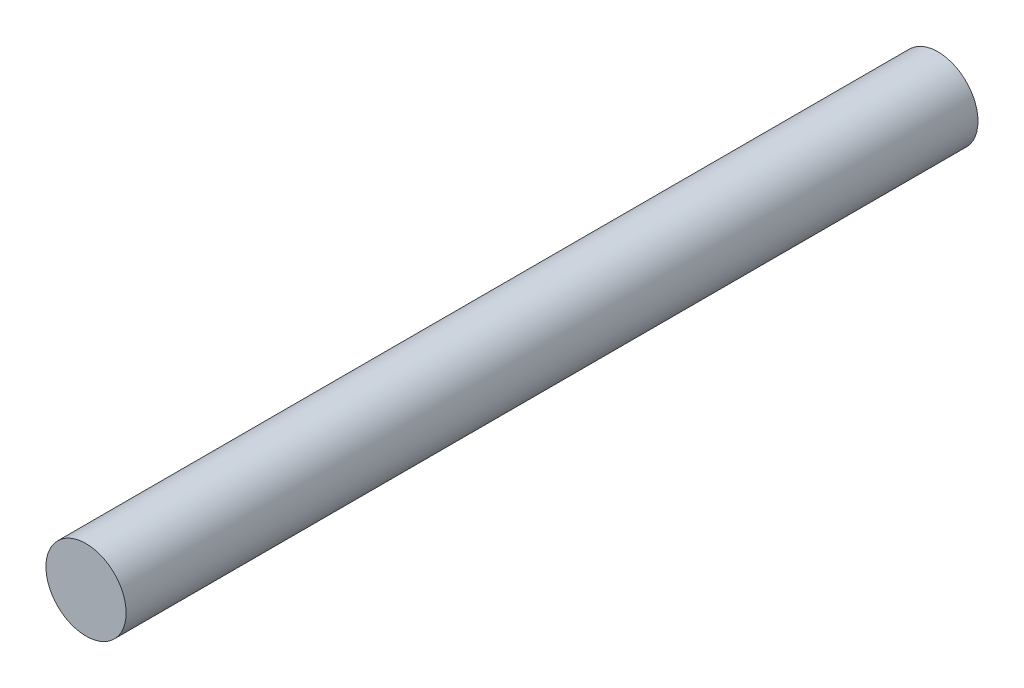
ISO-10303-21;
HEADER;
FILE_DESCRIPTION(('STEP AP214'),'2;1');
FILE_NAME('part.step','',(''),(''),'','','');
FILE_SCHEMA(('AUTOMOTIVE_DESIGN { 1 0 10303 214 1 1 1 1 }'));
ENDSEC;
DATA;
#1=APPLICATION_CONTEXT('core data for automotive mechanical design processes');
#2=APPLICATION_PROTOCOL_DEFINITION('international standard','automotive_design',2000,#1);
#3=PRODUCT_CONTEXT('',#1,'mechanical');
#4=PRODUCT('Part','Part','',(#3));
#5=PRODUCT_RELATED_PRODUCT_CATEGORY('part','',(#4));
#6=PRODUCT_DEFINITION_FORMATION('','',#4);
#7=PRODUCT_DEFINITION_CONTEXT('part definition',#1,'design');
#8=PRODUCT_DEFINITION('design','',#6,#7);
#9=PRODUCT_DEFINITION_SHAPE('','',#8);
#10=(LENGTH_UNIT() NAMED_UNIT(*) SI_UNIT(.MILLI.,.METRE.));
#11=(NAMED_UNIT(*) PLANE_ANGLE_UNIT() SI_UNIT($,.RADIAN.));
#12=(NAMED_UNIT(*) SI_UNIT($,.STERADIAN.) SOLID_ANGLE_UNIT());
#13=UNCERTAINTY_MEASURE_WITH_UNIT(LENGTH_MEASURE(1.E-05),#10,'distance_accuracy_value','');
#14=(GEOMETRIC_REPRESENTATION_CONTEXT(3) GLOBAL_UNCERTAINTY_ASSIGNED_CONTEXT((#13)) GLOBAL_UNIT_ASSIGNED_CONTEXT((#10,
#11,#12)) REPRESENTATION_CONTEXT('',''));
#15=CARTESIAN_POINT('',(0.,0.,0.));
#16=DIRECTION('',(0.,0.,1.));
#17=DIRECTION('',(1.,0.,0.));
#18=AXIS2_PLACEMENT_3D('',#15,#16,#17);
#19=CARTESIAN_POINT('',(45.,0.,-85.));
#20=DIRECTION('',(0.,0.,1.));
#21=DIRECTION('',(1.,0.,0.));
#22=AXIS2_PLACEMENT_3D('',#19,#20,#21);
#23=CYLINDRICAL_SURFACE('',#22,4.00000000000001);
#24=CARTESIAN_POINT('',(45.,0.,-85.));
#25=DIRECTION('',(0.,0.,1.));
#26=DIRECTION('',(1.,0.,0.));
#27=AXIS2_PLACEMENT_3D('',#24,#25,#26);
#28=CIRCLE('',#27,4.00000000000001);
#29=CARTESIAN_POINT('',(49.,0.,-85.));
#30=VERTEX_POINT('',#29);
#31=EDGE_CURVE('E10',#30,#30,#28,.T.);
#32=ORIENTED_EDGE('',*,*,#31,.T.);
#33=EDGE_LOOP('',(#32));
#34=FACE_BOUND('',#33,.T.);
#35=CARTESIAN_POINT('',(45.,0.,0.));
#36=DIRECTION('',(0.,0.,1.));
#37=DIRECTION('',(1.,0.,0.));
#38=AXIS2_PLACEMENT_3D('',#35,#36,#37);
#39=CIRCLE('',#38,4.00000000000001);
#40=CARTESIAN_POINT('',(49.,0.,0.));
#41=VERTEX_POINT('',#40);
#42=EDGE_CURVE('E32',#41,#41,#39,.T.);
#43=ORIENTED_EDGE('',*,*,#42,.F.);
#44=EDGE_LOOP('',(#43));
#45=FACE_BOUND('',#44,.T.);
#46=ADVANCED_FACE('F26',(#34,#45),#23,.T.);
#47=CARTESIAN_POINT('',(45.,0.,-85.));
#48=DIRECTION('',(0.,0.,1.));
#49=DIRECTION('',(1.,0.,0.));
#50=AXIS2_PLACEMENT_3D('',#47,#48,#49);
#51=PLANE('',#50);
#52=ORIENTED_EDGE('',*,*,#31,.F.);
#53=EDGE_LOOP('',(#52));
#54=FACE_BOUND('',#53,.T.);
#55=ADVANCED_FACE('F41',(#54),#51,.F.);
#56=CARTESIAN_POINT('',(45.,0.,0.));
#57=DIRECTION('',(0.,0.,1.));
#58=DIRECTION('',(1.,0.,0.));
#59=AXIS2_PLACEMENT_3D('',#56,#57,#58);
#60=PLANE('',#59);
#61=ORIENTED_EDGE('',*,*,#42,.T.);
#62=EDGE_LOOP('',(#61));
#63=FACE_BOUND('',#62,.T.);
#64=ADVANCED_FACE('F38',(#63),#60,.T.);
#65=CLOSED_SHELL('',(#46,#55,#64));
#66=MANIFOLD_SOLID_BREP('B2',#65);
#67=ADVANCED_BREP_SHAPE_REPRESENTATION('',(#18,#66),#14);
#68=SHAPE_DEFINITION_REPRESENTATION(#9,#67);
ENDSEC;
END-ISO-10303-21;
